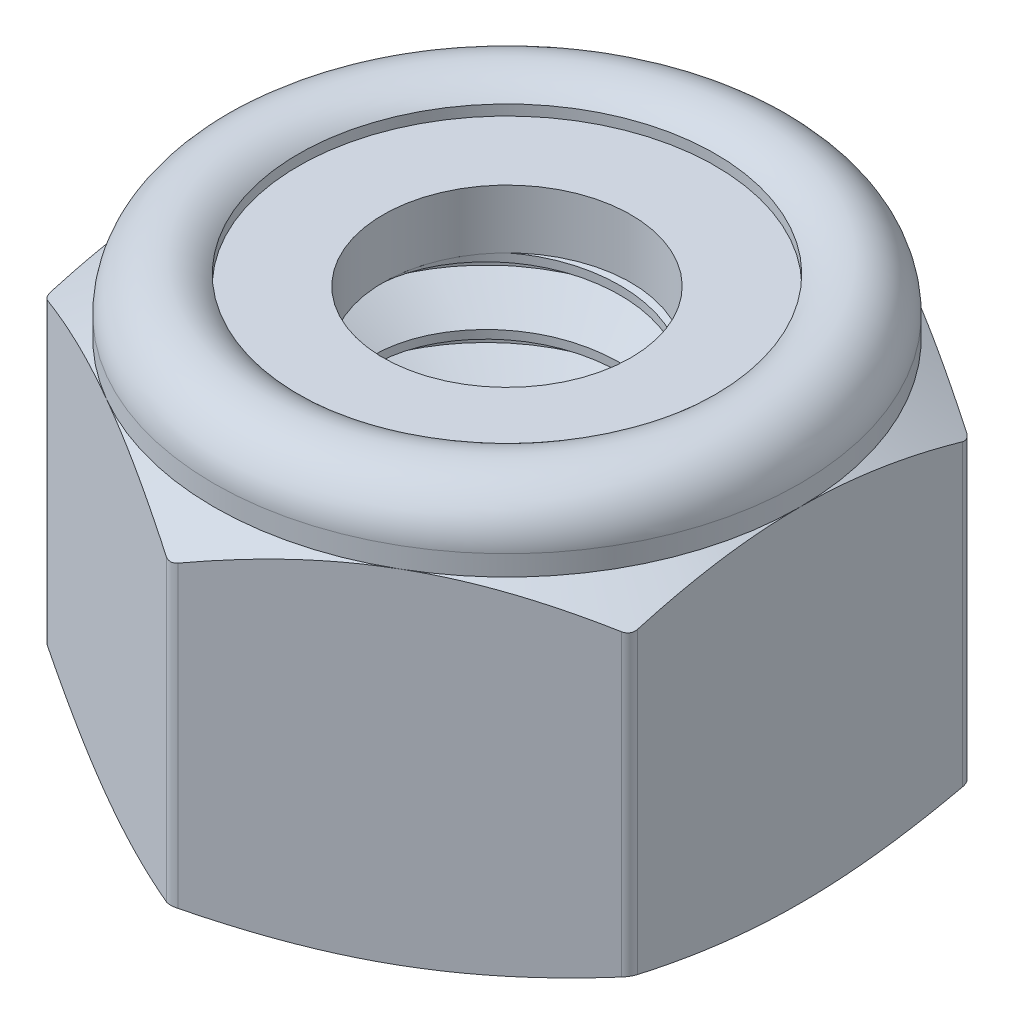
from build123d import *

# Parameters (mm, degrees)
BOSS_EXTRUDE1_DEPTH      = 3.96875
BOSS_EXTRUDE1_DEPTH_BACK = 3.96875
SKETCH2_R                = 2.350110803
FILLET1_R                = 0.22225
SKETCH4_W                = 1.603069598
SKETCH4_H                = 1.11401924
SKETCH6_W                = 3.175
SKETCH6_H                = 6.614583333
CUT_SWEEP1_PITCH         = 1.27
CUT_SWEEP1_HEIGHT        = 7.9375
CUT_SWEEP1_RADIUS        = 3.175
CUT_SWEEP1_START_ANGLE   = 90
SKETCH10_R               = 2.985110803
BOSS_EXTRUDE2_DEPTH      = 6.35


with BuildPart() as part:
    # Sketch2 → Boss-Extrude1 (new, two sides: drawn at the far end of the back side and taken through both)
    with BuildSketch(Plane(origin=(0, 0, 0), x_dir=(1, 0, 0), z_dir=(0, 1, 0)).offset(-BOSS_EXTRUDE1_DEPTH_BACK)):
        Polygon((0, 6.415804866), (-5.55625, 3.207902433), (-5.55625, -3.207902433), (0, -6.415804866), (5.55625, -3.207902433), (5.55625, 3.207902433), align=None)
        with Locations(Location((0, 0, 0), (0, 0, 270))):
            Circle(SKETCH2_R, mode=Mode.SUBTRACT)
    extrude(amount=BOSS_EXTRUDE1_DEPTH + BOSS_EXTRUDE1_DEPTH_BACK)

    # Fillet1
    fillet1_edges = [part.edges().sort_by_distance(p)[0] for p in [
        (5.55625, 0, -3.207902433),
        (5.55625, 0, 3.207902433),
        (0, 0, 6.415804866),
        (-5.55625, 0, 3.207902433),
        (-5.55625, 0, -3.207902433),
        (0, 0, -6.415804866),
    ]]
    fillet(fillet1_edges, radius=FILLET1_R)

    # Sketch3 → Cut-Revolve2 (revolve, cut)
    with BuildSketch(Plane(origin=(0, 0, 0), x_dir=(0, 0, -1), z_dir=(1, 0, 0)), mode=Mode.PRIVATE) as cut_revolve2_sk:
        with BuildLine():
            Line((6.415804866, 2.645833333), (6.415804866, 4.96875))
            Line((6.415804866, 4.96875), (2.350110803, 4.96875))
            Line((2.350110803, 4.96875), (2.350110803, 2.38125))
            Line((2.350110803, 2.38125), (3.953180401, 2.38125))
            Line((3.953180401, 2.38125), (3.953180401, 3.69370674))
            ThreePointArc((3.953180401, 3.69370674), (4.976554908, 3.897268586), (5.55625, 3.029693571))
            Line((5.55625, 3.029693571), (5.55625, 2.645833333))
            Line((5.55625, 2.645833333), (6.415804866, 2.14137944))
            Line((6.415804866, 2.14137944), (6.415804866, 2.645833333))
        make_face()
        Polygon((5.334, -3.96875), (6.415804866, -3.464296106), (6.415804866, -3.96875), align=None)
        Polygon((2.350110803, -3.96875), (2.350110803, -3.33375), (2.985110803, -3.96875), align=None)
    revolve(cut_revolve2_sk.sketch.rotate(Axis((0, -3.96875, 0), (0, 1, 0)), 270), axis=Axis((0, -3.96875, 0), (0, 1, 0)), mode=Mode.SUBTRACT)

    # Sketch10 → Boss-Extrude2 (add)
    with BuildSketch(Plane.XZ.offset(3.96875)):
        Circle(SKETCH10_R)
    extrude(amount=-BOSS_EXTRUDE2_DEPTH)


with BuildPart() as body_2:
    # Sketch4 → Revolve1 (revolve)
    with BuildSketch(Plane(origin=(0, 0, 0), x_dir=(0, 0, -1), z_dir=(1, 0, 0)), mode=Mode.PRIVATE) as revolve1_sk:
        with Locations((-3.151645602, 2.93825962)):
            Rectangle(SKETCH4_W, SKETCH4_H)
    revolve(revolve1_sk.sketch.rotate(Axis((0, -3.96875, 0), (0, 1, 0)), 90), axis=Axis((0, -3.96875, 0), (0, 1, 0)))


with BuildPart() as body_3:
    # Sketch6 → Revolve2 (revolve)
    with BuildSketch(Plane.XY, mode=Mode.PRIVATE) as revolve2_sk:
        with Locations((1.5875, -0.661458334)):
            Rectangle(SKETCH6_W, SKETCH6_H)
    revolve(revolve2_sk.sketch.rotate(Axis((0, -3.96875, 0), (0, 1, 0)), 90), axis=Axis((0, -3.96875, 0), (0, 1, 0)))

    # Cut-Sweep1: sweep along a helix
    with BuildLine() as cut_sweep1_path:
        add(Helix(CUT_SWEEP1_PITCH, CUT_SWEEP1_HEIGHT, CUT_SWEEP1_RADIUS, center=(0, -3.96875, 0), direction=(0, 1, 0), mode=Mode.PRIVATE).rotate(Axis((0, -3.96875, 0), (0, 1, 0)), CUT_SWEEP1_START_ANGLE))
    # Sketch8 → Cut-Sweep1 (sweep, cut)
    with BuildSketch(Plane.XY):
        Polygon((2.350110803, -4.445), (2.350110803, -4.60375), (3.243740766, -5.1196875), (3.312481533, -3.889375), align=None)
    sweep(path=cut_sweep1_path.line, is_frenet=True, mode=Mode.SUBTRACT)

    # Sketch9 → Revolve3 (revolve)
    with BuildSketch(Plane.XY, mode=Mode.PRIVATE) as revolve3_sk:
        Polygon((0, -0.79375), (0, -3.96875), (3.175, -3.96875), (3.81, -3.96875), (0, -0.15875), align=None)
    revolve(revolve3_sk.sketch.rotate(Axis((0, -0.79375, 0), (0, -1, 0)), 180), axis=Axis((0, -0.79375, 0), (0, -1, 0)))


with BuildPart() as part_1:
    add(part.part)

    # Combine1: cut body 3
    add(body_3.part, mode=Mode.SUBTRACT)


solid = Compound([body_2.part, part_1.part])
